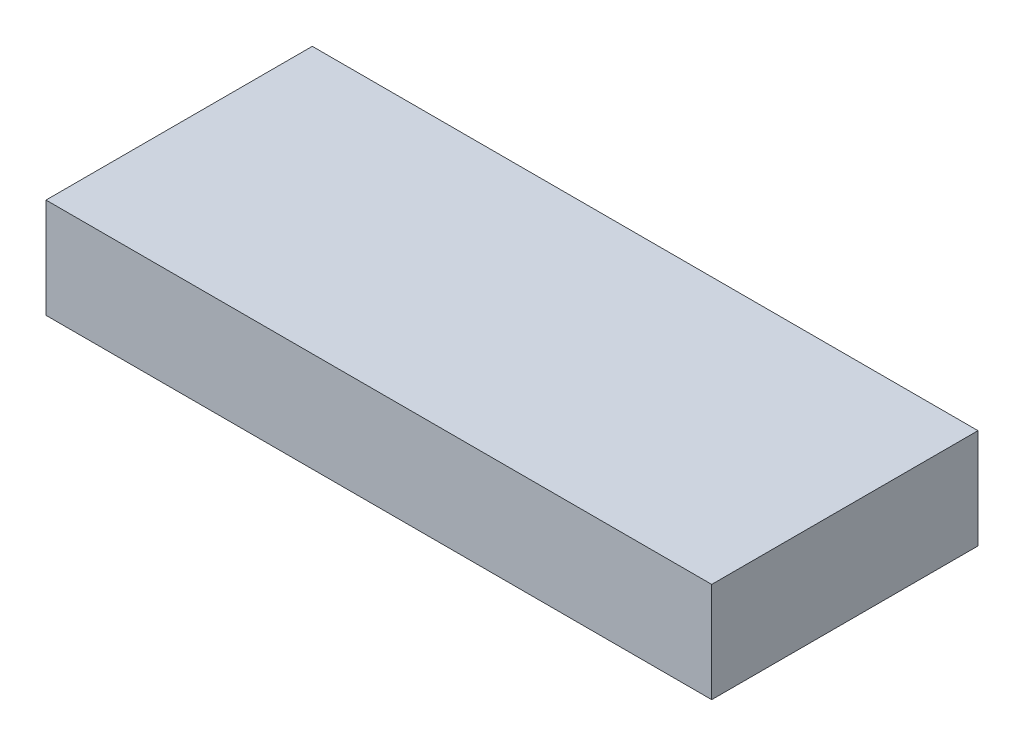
ISO-10303-21;
HEADER;
FILE_DESCRIPTION(('STEP AP214'),'2;1');
FILE_NAME('part.step','',(''),(''),'','','');
FILE_SCHEMA(('AUTOMOTIVE_DESIGN { 1 0 10303 214 1 1 1 1 }'));
ENDSEC;
DATA;
#1=APPLICATION_CONTEXT('core data for automotive mechanical design processes');
#2=APPLICATION_PROTOCOL_DEFINITION('international standard','automotive_design',2000,#1);
#3=PRODUCT_CONTEXT('',#1,'mechanical');
#4=PRODUCT('Part','Part','',(#3));
#5=PRODUCT_RELATED_PRODUCT_CATEGORY('part','',(#4));
#6=PRODUCT_DEFINITION_FORMATION('','',#4);
#7=PRODUCT_DEFINITION_CONTEXT('part definition',#1,'design');
#8=PRODUCT_DEFINITION('design','',#6,#7);
#9=PRODUCT_DEFINITION_SHAPE('','',#8);
#10=(LENGTH_UNIT() NAMED_UNIT(*) SI_UNIT(.MILLI.,.METRE.));
#11=(NAMED_UNIT(*) PLANE_ANGLE_UNIT() SI_UNIT($,.RADIAN.));
#12=(NAMED_UNIT(*) SI_UNIT($,.STERADIAN.) SOLID_ANGLE_UNIT());
#13=UNCERTAINTY_MEASURE_WITH_UNIT(LENGTH_MEASURE(1.E-05),#10,'distance_accuracy_value','');
#14=(GEOMETRIC_REPRESENTATION_CONTEXT(3) GLOBAL_UNCERTAINTY_ASSIGNED_CONTEXT((#13)) GLOBAL_UNIT_ASSIGNED_CONTEXT((#10,
#11,#12)) REPRESENTATION_CONTEXT('',''));
#15=CARTESIAN_POINT('',(0.,0.,0.));
#16=DIRECTION('',(0.,0.,1.));
#17=DIRECTION('',(1.,0.,0.));
#18=AXIS2_PLACEMENT_3D('',#15,#16,#17);
#19=CARTESIAN_POINT('',(0.,38.1,-101.6));
#20=DIRECTION('',(0.,0.,1.));
#21=DIRECTION('',(1.,0.,0.));
#22=AXIS2_PLACEMENT_3D('',#19,#20,#21);
#23=PLANE('',#22);
#24=DIRECTION('',(0.,1.,0.));
#25=VECTOR('',#24,1.);
#26=CARTESIAN_POINT('',(191.29375,38.1,-101.6));
#27=LINE('',#26,#25);
#28=CARTESIAN_POINT('',(191.29375,0.,-101.6));
#29=VERTEX_POINT('',#28);
#30=CARTESIAN_POINT('',(191.29375,6.35,-101.6));
#31=VERTEX_POINT('',#30);
#32=EDGE_CURVE('E575',#29,#31,#27,.T.);
#33=ORIENTED_EDGE('',*,*,#32,.F.);
#34=DIRECTION('',(-1.,0.,0.));
#35=VECTOR('',#34,1.);
#36=CARTESIAN_POINT('',(0.,0.,-101.6));
#37=LINE('',#36,#35);
#38=CARTESIAN_POINT('',(0.,0.,-101.6));
#39=VERTEX_POINT('',#38);
#40=EDGE_CURVE('E76',#29,#39,#37,.T.);
#41=ORIENTED_EDGE('',*,*,#40,.T.);
#42=DIRECTION('',(0.,-1.,0.));
#43=VECTOR('',#42,1.);
#44=CARTESIAN_POINT('',(0.,38.1,-101.6));
#45=LINE('',#44,#43);
#46=CARTESIAN_POINT('',(0.,38.1,-101.6));
#47=VERTEX_POINT('',#46);
#48=EDGE_CURVE('E585',#47,#39,#45,.T.);
#49=ORIENTED_EDGE('',*,*,#48,.F.);
#50=DIRECTION('',(-1.,0.,0.));
#51=VECTOR('',#50,1.);
#52=CARTESIAN_POINT('',(0.,38.1,-101.6));
#53=LINE('',#52,#51);
#54=CARTESIAN_POINT('',(254.,38.1,-101.6));
#55=VERTEX_POINT('',#54);
#56=EDGE_CURVE('E55',#55,#47,#53,.T.);
#57=ORIENTED_EDGE('',*,*,#56,.F.);
#58=DIRECTION('',(0.,-1.,0.));
#59=VECTOR('',#58,1.);
#60=CARTESIAN_POINT('',(254.,38.1,-101.6));
#61=LINE('',#60,#59);
#62=CARTESIAN_POINT('',(254.,0.,-101.6));
#63=VERTEX_POINT('',#62);
#64=EDGE_CURVE('E596',#55,#63,#61,.T.);
#65=ORIENTED_EDGE('',*,*,#64,.T.);
#66=CARTESIAN_POINT('',(218.28125,0.,-101.6));
#67=VERTEX_POINT('',#66);
#68=EDGE_CURVE('E580',#63,#67,#37,.T.);
#69=ORIENTED_EDGE('',*,*,#68,.T.);
#70=DIRECTION('',(0.,-1.,0.));
#71=VECTOR('',#70,1.);
#72=CARTESIAN_POINT('',(218.28125,38.1,-101.6));
#73=LINE('',#72,#71);
#74=CARTESIAN_POINT('',(218.28125,6.34999999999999,-101.6));
#75=VERTEX_POINT('',#74);
#76=EDGE_CURVE('E573',#75,#67,#73,.T.);
#77=ORIENTED_EDGE('',*,*,#76,.F.);
#78=DIRECTION('',(1.,0.,0.));
#79=VECTOR('',#78,1.);
#80=CARTESIAN_POINT('',(0.,6.34999999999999,-101.6));
#81=LINE('',#80,#79);
#82=CARTESIAN_POINT('',(231.775,6.34999999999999,-101.6));
#83=VERTEX_POINT('',#82);
#84=EDGE_CURVE('E604',#75,#83,#81,.T.);
#85=ORIENTED_EDGE('',*,*,#84,.T.);
#86=DIRECTION('',(0.,-1.,0.));
#87=VECTOR('',#86,1.);
#88=CARTESIAN_POINT('',(231.775,38.1,-101.6));
#89=LINE('',#88,#87);
#90=CARTESIAN_POINT('',(231.775,12.7,-101.6));
#91=VERTEX_POINT('',#90);
#92=EDGE_CURVE('E607',#91,#83,#89,.T.);
#93=ORIENTED_EDGE('',*,*,#92,.F.);
#94=DIRECTION('',(-1.,0.,0.));
#95=VECTOR('',#94,1.);
#96=CARTESIAN_POINT('',(0.,12.7,-101.6));
#97=LINE('',#96,#95);
#98=CARTESIAN_POINT('',(218.28125,12.7,-101.6));
#99=VERTEX_POINT('',#98);
#100=EDGE_CURVE('E609',#91,#99,#97,.T.);
#101=ORIENTED_EDGE('',*,*,#100,.T.);
#102=DIRECTION('',(0.,-1.,0.));
#103=VECTOR('',#102,1.);
#104=CARTESIAN_POINT('',(218.28125,38.1,-101.6));
#105=LINE('',#104,#103);
#106=CARTESIAN_POINT('',(218.28125,25.4,-101.6));
#107=VERTEX_POINT('',#106);
#108=EDGE_CURVE('E612',#107,#99,#105,.T.);
#109=ORIENTED_EDGE('',*,*,#108,.F.);
#110=DIRECTION('',(-1.,0.,0.));
#111=VECTOR('',#110,1.);
#112=CARTESIAN_POINT('',(0.,25.4,-101.6));
#113=LINE('',#112,#111);
#114=CARTESIAN_POINT('',(191.29375,25.4,-101.6));
#115=VERTEX_POINT('',#114);
#116=EDGE_CURVE('E614',#107,#115,#113,.T.);
#117=ORIENTED_EDGE('',*,*,#116,.T.);
#118=DIRECTION('',(0.,1.,0.));
#119=VECTOR('',#118,1.);
#120=CARTESIAN_POINT('',(191.29375,38.1,-101.6));
#121=LINE('',#120,#119);
#122=CARTESIAN_POINT('',(191.29375,12.7,-101.6));
#123=VERTEX_POINT('',#122);
#124=EDGE_CURVE('E617',#123,#115,#121,.T.);
#125=ORIENTED_EDGE('',*,*,#124,.F.);
#126=DIRECTION('',(-1.,0.,0.));
#127=VECTOR('',#126,1.);
#128=CARTESIAN_POINT('',(0.,12.7,-101.6));
#129=LINE('',#128,#127);
#130=CARTESIAN_POINT('',(177.8,12.7,-101.6));
#131=VERTEX_POINT('',#130);
#132=EDGE_CURVE('E619',#123,#131,#129,.T.);
#133=ORIENTED_EDGE('',*,*,#132,.T.);
#134=DIRECTION('',(0.,1.,0.));
#135=VECTOR('',#134,1.);
#136=CARTESIAN_POINT('',(177.8,38.1,-101.6));
#137=LINE('',#136,#135);
#138=CARTESIAN_POINT('',(177.8,6.35,-101.6));
#139=VERTEX_POINT('',#138);
#140=EDGE_CURVE('E39',#139,#131,#137,.T.);
#141=ORIENTED_EDGE('',*,*,#140,.F.);
#142=DIRECTION('',(1.,0.,0.));
#143=VECTOR('',#142,1.);
#144=CARTESIAN_POINT('',(0.,6.35,-101.6));
#145=LINE('',#144,#143);
#146=EDGE_CURVE('E11',#139,#31,#145,.T.);
#147=ORIENTED_EDGE('',*,*,#146,.T.);
#148=EDGE_LOOP('',(#33,#41,#49,#57,#65,#69,#77,#85,#93,#101,#109,#117,#125,#133,#141,#147));
#149=FACE_BOUND('',#148,.T.);
#150=ADVANCED_FACE('F31',(#149),#23,.F.);
#151=CARTESIAN_POINT('',(0.,0.,-101.6));
#152=DIRECTION('',(0.,-1.,0.));
#153=DIRECTION('',(0.,0.,-1.));
#154=AXIS2_PLACEMENT_3D('',#151,#152,#153);
#155=PLANE('',#154);
#156=ORIENTED_EDGE('',*,*,#40,.F.);
#157=DIRECTION('',(0.88235294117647,0.,-0.470588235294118));
#158=VECTOR('',#157,1.);
#159=CARTESIAN_POINT('',(169.582352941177,0.,-90.0205882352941));
#160=LINE('',#159,#158);
#161=CARTESIAN_POINT('',(169.582352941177,0.,-90.0205882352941));
#162=VERTEX_POINT('',#161);
#163=EDGE_CURVE('E571',#162,#29,#160,.T.);
#164=ORIENTED_EDGE('',*,*,#163,.F.);
#165=CARTESIAN_POINT('',(190.5,0.,-50.8));
#166=DIRECTION('',(0.,-1.,0.));
#167=DIRECTION('',(0.,0.,-1.));
#168=AXIS2_PLACEMENT_3D('',#165,#166,#167);
#169=CIRCLE('',#168,44.45);
#170=CARTESIAN_POINT('',(146.05,0.,-50.8));
#171=VERTEX_POINT('',#170);
#172=EDGE_CURVE('E535',#171,#162,#169,.T.);
#173=ORIENTED_EDGE('',*,*,#172,.F.);
#174=CARTESIAN_POINT('',(120.65,0.,-50.8));
#175=DIRECTION('',(0.,1.,0.));
#176=DIRECTION('',(0.,0.,1.));
#177=AXIS2_PLACEMENT_3D('',#174,#175,#176);
#178=CIRCLE('',#177,25.4);
#179=CARTESIAN_POINT('',(95.25,0.,-50.8));
#180=VERTEX_POINT('',#179);
#181=EDGE_CURVE('E482',#180,#171,#178,.T.);
#182=ORIENTED_EDGE('',*,*,#181,.F.);
#183=CARTESIAN_POINT('',(63.5,0.,-50.8));
#184=DIRECTION('',(0.,-1.,0.));
#185=DIRECTION('',(0.,0.,-1.));
#186=AXIS2_PLACEMENT_3D('',#183,#184,#185);
#187=CIRCLE('',#186,31.75);
#188=CARTESIAN_POINT('',(63.5,0.,-82.55));
#189=VERTEX_POINT('',#188);
#190=EDGE_CURVE('E431',#189,#180,#187,.T.);
#191=ORIENTED_EDGE('',*,*,#190,.F.);
#192=DIRECTION('',(-1.,0.,0.));
#193=VECTOR('',#192,1.);
#194=CARTESIAN_POINT('',(63.5,0.,-82.55));
#195=LINE('',#194,#193);
#196=CARTESIAN_POINT('',(0.,0.,-82.55));
#197=VERTEX_POINT('',#196);
#198=EDGE_CURVE('E367',#189,#197,#195,.T.);
#199=ORIENTED_EDGE('',*,*,#198,.T.);
#200=DIRECTION('',(0.,0.,1.));
#201=VECTOR('',#200,1.);
#202=CARTESIAN_POINT('',(0.,0.,0.));
#203=LINE('',#202,#201);
#204=EDGE_CURVE('E586',#39,#197,#203,.T.);
#205=ORIENTED_EDGE('',*,*,#204,.F.);
#206=EDGE_LOOP('',(#156,#164,#173,#182,#191,#199,#205));
#207=FACE_BOUND('',#206,.T.);
#208=ADVANCED_FACE('F674',(#207),#155,.T.);
#209=CARTESIAN_POINT('',(190.5,0.,-50.8));
#210=DIRECTION('',(0.,-1.,0.));
#211=DIRECTION('',(0.,0.,-1.));
#212=AXIS2_PLACEMENT_3D('',#209,#210,#211);
#213=CIRCLE('',#212,31.75);
#214=CARTESIAN_POINT('',(158.75,0.,-50.8));
#215=VERTEX_POINT('',#214);
#216=CARTESIAN_POINT('',(175.558823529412,0.,-78.8147058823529));
#217=VERTEX_POINT('',#216);
#218=EDGE_CURVE('E502',#215,#217,#213,.T.);
#219=ORIENTED_EDGE('',*,*,#218,.T.);
#220=DIRECTION('',(0.88235294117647,0.,-0.470588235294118));
#221=VECTOR('',#220,1.);
#222=CARTESIAN_POINT('',(175.558823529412,0.,-78.8147058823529));
#223=LINE('',#222,#221);
#224=EDGE_CURVE('E538',#217,#67,#223,.T.);
#225=ORIENTED_EDGE('',*,*,#224,.T.);
#226=ORIENTED_EDGE('',*,*,#68,.F.);
#227=DIRECTION('',(0.,0.,-1.));
#228=VECTOR('',#227,1.);
#229=CARTESIAN_POINT('',(254.,0.,0.));
#230=LINE('',#229,#228);
#231=CARTESIAN_POINT('',(254.,0.,0.));
#232=VERTEX_POINT('',#231);
#233=EDGE_CURVE('E591',#232,#63,#230,.T.);
#234=ORIENTED_EDGE('',*,*,#233,.F.);
#235=DIRECTION('',(1.,0.,0.));
#236=VECTOR('',#235,1.);
#237=CARTESIAN_POINT('',(0.,0.,0.));
#238=LINE('',#237,#236);
#239=CARTESIAN_POINT('',(0.,0.,0.));
#240=VERTEX_POINT('',#239);
#241=EDGE_CURVE('E589',#240,#232,#238,.T.);
#242=ORIENTED_EDGE('',*,*,#241,.F.);
#243=CARTESIAN_POINT('',(0.,0.,-69.85));
#244=VERTEX_POINT('',#243);
#245=EDGE_CURVE('E577',#244,#240,#203,.T.);
#246=ORIENTED_EDGE('',*,*,#245,.F.);
#247=DIRECTION('',(-1.,0.,0.));
#248=VECTOR('',#247,1.);
#249=CARTESIAN_POINT('',(63.5,0.,-69.85));
#250=LINE('',#249,#248);
#251=CARTESIAN_POINT('',(63.5,0.,-69.85));
#252=VERTEX_POINT('',#251);
#253=EDGE_CURVE('E316',#252,#244,#250,.T.);
#254=ORIENTED_EDGE('',*,*,#253,.F.);
#255=CARTESIAN_POINT('',(63.5,0.,-50.8));
#256=DIRECTION('',(0.,-1.,0.));
#257=DIRECTION('',(0.,0.,-1.));
#258=AXIS2_PLACEMENT_3D('',#255,#256,#257);
#259=CIRCLE('',#258,19.05);
#260=CARTESIAN_POINT('',(82.55,0.,-50.8));
#261=VERTEX_POINT('',#260);
#262=EDGE_CURVE('E309',#252,#261,#259,.T.);
#263=ORIENTED_EDGE('',*,*,#262,.T.);
#264=CARTESIAN_POINT('',(120.65,0.,-50.8));
#265=DIRECTION('',(0.,1.,0.));
#266=DIRECTION('',(0.,0.,1.));
#267=AXIS2_PLACEMENT_3D('',#264,#265,#266);
#268=CIRCLE('',#267,38.1);
#269=EDGE_CURVE('E451',#261,#215,#268,.T.);
#270=ORIENTED_EDGE('',*,*,#269,.T.);
#271=EDGE_LOOP('',(#219,#225,#226,#234,#242,#246,#254,#263,#270));
#272=FACE_BOUND('',#271,.T.);
#273=ADVANCED_FACE('F687',(#272),#155,.T.);
#274=CARTESIAN_POINT('',(0.,38.1,0.));
#275=DIRECTION('',(1.,0.,0.));
#276=DIRECTION('',(0.,0.,-1.));
#277=AXIS2_PLACEMENT_3D('',#274,#275,#276);
#278=PLANE('',#277);
#279=ORIENTED_EDGE('',*,*,#204,.T.);
#280=DIRECTION('',(0.,-1.,0.));
#281=VECTOR('',#280,1.);
#282=CARTESIAN_POINT('',(0.,0.,-82.55));
#283=LINE('',#282,#281);
#284=CARTESIAN_POINT('',(0.,6.35,-82.55));
#285=VERTEX_POINT('',#284);
#286=EDGE_CURVE('E322',#285,#197,#283,.T.);
#287=ORIENTED_EDGE('',*,*,#286,.F.);
#288=DIRECTION('',(0.,0.,1.));
#289=VECTOR('',#288,1.);
#290=CARTESIAN_POINT('',(0.,6.35,-82.55));
#291=LINE('',#290,#289);
#292=CARTESIAN_POINT('',(0.,6.35,-88.9));
#293=VERTEX_POINT('',#292);
#294=EDGE_CURVE('E327',#293,#285,#291,.T.);
#295=ORIENTED_EDGE('',*,*,#294,.F.);
#296=DIRECTION('',(0.,-1.,0.));
#297=VECTOR('',#296,1.);
#298=CARTESIAN_POINT('',(0.,6.35,-88.9));
#299=LINE('',#298,#297);
#300=CARTESIAN_POINT('',(0.,12.7,-88.9));
#301=VERTEX_POINT('',#300);
#302=EDGE_CURVE('E362',#301,#293,#299,.T.);
#303=ORIENTED_EDGE('',*,*,#302,.F.);
#304=DIRECTION('',(0.,0.,-1.));
#305=VECTOR('',#304,1.);
#306=CARTESIAN_POINT('',(0.,12.7,-88.9));
#307=LINE('',#306,#305);
#308=CARTESIAN_POINT('',(0.,12.7,-82.55));
#309=VERTEX_POINT('',#308);
#310=EDGE_CURVE('E359',#309,#301,#307,.T.);
#311=ORIENTED_EDGE('',*,*,#310,.F.);
#312=DIRECTION('',(0.,-1.,0.));
#313=VECTOR('',#312,1.);
#314=CARTESIAN_POINT('',(0.,12.7,-82.55));
#315=LINE('',#314,#313);
#316=CARTESIAN_POINT('',(0.,25.4,-82.55));
#317=VERTEX_POINT('',#316);
#318=EDGE_CURVE('E356',#317,#309,#315,.T.);
#319=ORIENTED_EDGE('',*,*,#318,.F.);
#320=DIRECTION('',(0.,0.,-1.));
#321=VECTOR('',#320,1.);
#322=CARTESIAN_POINT('',(0.,25.4,-82.55));
#323=LINE('',#322,#321);
#324=CARTESIAN_POINT('',(0.,25.4,-69.85));
#325=VERTEX_POINT('',#324);
#326=EDGE_CURVE('E353',#325,#317,#323,.T.);
#327=ORIENTED_EDGE('',*,*,#326,.F.);
#328=DIRECTION('',(0.,1.,0.));
#329=VECTOR('',#328,1.);
#330=CARTESIAN_POINT('',(0.,25.4,-69.85));
#331=LINE('',#330,#329);
#332=CARTESIAN_POINT('',(0.,12.7,-69.85));
#333=VERTEX_POINT('',#332);
#334=EDGE_CURVE('E350',#333,#325,#331,.T.);
#335=ORIENTED_EDGE('',*,*,#334,.F.);
#336=DIRECTION('',(0.,0.,-1.));
#337=VECTOR('',#336,1.);
#338=CARTESIAN_POINT('',(0.,12.7,-69.85));
#339=LINE('',#338,#337);
#340=CARTESIAN_POINT('',(0.,12.7,-63.5));
#341=VERTEX_POINT('',#340);
#342=EDGE_CURVE('E347',#341,#333,#339,.T.);
#343=ORIENTED_EDGE('',*,*,#342,.F.);
#344=DIRECTION('',(0.,1.,0.));
#345=VECTOR('',#344,1.);
#346=CARTESIAN_POINT('',(0.,12.7,-63.5));
#347=LINE('',#346,#345);
#348=CARTESIAN_POINT('',(0.,6.35,-63.5));
#349=VERTEX_POINT('',#348);
#350=EDGE_CURVE('E344',#349,#341,#347,.T.);
#351=ORIENTED_EDGE('',*,*,#350,.F.);
#352=DIRECTION('',(0.,0.,1.));
#353=VECTOR('',#352,1.);
#354=CARTESIAN_POINT('',(0.,6.35,-63.5));
#355=LINE('',#354,#353);
#356=CARTESIAN_POINT('',(0.,6.35,-69.85));
#357=VERTEX_POINT('',#356);
#358=EDGE_CURVE('E342',#357,#349,#355,.T.);
#359=ORIENTED_EDGE('',*,*,#358,.F.);
#360=DIRECTION('',(0.,1.,0.));
#361=VECTOR('',#360,1.);
#362=CARTESIAN_POINT('',(0.,6.35,-69.85));
#363=LINE('',#362,#361);
#364=EDGE_CURVE('E313',#244,#357,#363,.T.);
#365=ORIENTED_EDGE('',*,*,#364,.F.);
#366=ORIENTED_EDGE('',*,*,#245,.T.);
#367=DIRECTION('',(0.,-1.,0.));
#368=VECTOR('',#367,1.);
#369=CARTESIAN_POINT('',(0.,38.1,0.));
#370=LINE('',#369,#368);
#371=CARTESIAN_POINT('',(0.,38.1,0.));
#372=VERTEX_POINT('',#371);
#373=EDGE_CURVE('E602',#372,#240,#370,.T.);
#374=ORIENTED_EDGE('',*,*,#373,.F.);
#375=DIRECTION('',(0.,0.,1.));
#376=VECTOR('',#375,1.);
#377=CARTESIAN_POINT('',(0.,38.1,0.));
#378=LINE('',#377,#376);
#379=EDGE_CURVE('E578',#47,#372,#378,.T.);
#380=ORIENTED_EDGE('',*,*,#379,.F.);
#381=ORIENTED_EDGE('',*,*,#48,.T.);
#382=EDGE_LOOP('',(#279,#287,#295,#303,#311,#319,#327,#335,#343,#351,#359,#365,#366,#374,#380,#381));
#383=FACE_BOUND('',#382,.T.);
#384=ADVANCED_FACE('F33',(#383),#278,.F.);
#385=CARTESIAN_POINT('',(0.,38.1,0.));
#386=DIRECTION('',(0.,0.,-1.));
#387=DIRECTION('',(-1.,0.,0.));
#388=AXIS2_PLACEMENT_3D('',#385,#386,#387);
#389=PLANE('',#388);
#390=ORIENTED_EDGE('',*,*,#241,.T.);
#391=DIRECTION('',(0.,-1.,0.));
#392=VECTOR('',#391,1.);
#393=CARTESIAN_POINT('',(254.,38.1,0.));
#394=LINE('',#393,#392);
#395=CARTESIAN_POINT('',(254.,38.1,0.));
#396=VERTEX_POINT('',#395);
#397=EDGE_CURVE('E599',#396,#232,#394,.T.);
#398=ORIENTED_EDGE('',*,*,#397,.F.);
#399=DIRECTION('',(1.,0.,0.));
#400=VECTOR('',#399,1.);
#401=CARTESIAN_POINT('',(0.,38.1,0.));
#402=LINE('',#401,#400);
#403=EDGE_CURVE('E84',#372,#396,#402,.T.);
#404=ORIENTED_EDGE('',*,*,#403,.F.);
#405=ORIENTED_EDGE('',*,*,#373,.T.);
#406=EDGE_LOOP('',(#390,#398,#404,#405));
#407=FACE_BOUND('',#406,.T.);
#408=ADVANCED_FACE('F752',(#407),#389,.F.);
#409=CARTESIAN_POINT('',(254.,38.1,0.));
#410=DIRECTION('',(-1.,0.,0.));
#411=DIRECTION('',(0.,0.,1.));
#412=AXIS2_PLACEMENT_3D('',#409,#410,#411);
#413=PLANE('',#412);
#414=ORIENTED_EDGE('',*,*,#233,.T.);
#415=ORIENTED_EDGE('',*,*,#64,.F.);
#416=DIRECTION('',(0.,0.,-1.));
#417=VECTOR('',#416,1.);
#418=CARTESIAN_POINT('',(254.,38.1,0.));
#419=LINE('',#418,#417);
#420=EDGE_CURVE('E582',#396,#55,#419,.T.);
#421=ORIENTED_EDGE('',*,*,#420,.F.);
#422=ORIENTED_EDGE('',*,*,#397,.T.);
#423=EDGE_LOOP('',(#414,#415,#421,#422));
#424=FACE_BOUND('',#423,.T.);
#425=ADVANCED_FACE('F749',(#424),#413,.F.);
#426=CARTESIAN_POINT('',(0.,38.1,-101.6));
#427=DIRECTION('',(0.,-1.,0.));
#428=DIRECTION('',(0.,0.,-1.));
#429=AXIS2_PLACEMENT_3D('',#426,#427,#428);
#430=PLANE('',#429);
#431=ORIENTED_EDGE('',*,*,#379,.T.);
#432=ORIENTED_EDGE('',*,*,#403,.T.);
#433=ORIENTED_EDGE('',*,*,#420,.T.);
#434=ORIENTED_EDGE('',*,*,#56,.T.);
#435=EDGE_LOOP('',(#431,#432,#433,#434));
#436=FACE_BOUND('',#435,.T.);
#437=ADVANCED_FACE('F751',(#436),#430,.F.);
#438=CARTESIAN_POINT('',(166.594117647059,6.35,-95.6235294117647));
#439=DIRECTION('',(0.470588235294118,0.,0.882352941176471));
#440=DIRECTION('',(0.882352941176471,0.,-0.470588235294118));
#441=AXIS2_PLACEMENT_3D('',#438,#439,#440);
#442=PLANE('',#441);
#443=ORIENTED_EDGE('',*,*,#140,.T.);
#444=DIRECTION('',(0.88235294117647,0.,-0.470588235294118));
#445=VECTOR('',#444,1.);
#446=CARTESIAN_POINT('',(166.594117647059,12.7,-95.6235294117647));
#447=LINE('',#446,#445);
#448=CARTESIAN_POINT('',(166.594117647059,12.7,-95.6235294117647));
#449=VERTEX_POINT('',#448);
#450=EDGE_CURVE('E562',#449,#131,#447,.T.);
#451=ORIENTED_EDGE('',*,*,#450,.F.);
#452=DIRECTION('',(0.,-1.,0.));
#453=VECTOR('',#452,1.);
#454=CARTESIAN_POINT('',(166.594117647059,6.35,-95.6235294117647));
#455=LINE('',#454,#453);
#456=CARTESIAN_POINT('',(166.594117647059,6.35,-95.6235294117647));
#457=VERTEX_POINT('',#456);
#458=EDGE_CURVE('E497',#449,#457,#455,.T.);
#459=ORIENTED_EDGE('',*,*,#458,.T.);
#460=DIRECTION('',(0.88235294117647,0.,-0.470588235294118));
#461=VECTOR('',#460,1.);
#462=CARTESIAN_POINT('',(166.594117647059,6.35,-95.6235294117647));
#463=LINE('',#462,#461);
#464=EDGE_CURVE('E565',#457,#139,#463,.T.);
#465=ORIENTED_EDGE('',*,*,#464,.T.);
#466=EDGE_LOOP('',(#443,#451,#459,#465));
#467=FACE_BOUND('',#466,.T.);
#468=ADVANCED_FACE('F623',(#467),#442,.T.);
#469=CARTESIAN_POINT('',(169.582352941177,12.7,-90.0205882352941));
#470=DIRECTION('',(0.470588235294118,0.,0.88235294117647));
#471=DIRECTION('',(0.882352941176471,0.,-0.470588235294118));
#472=AXIS2_PLACEMENT_3D('',#469,#470,#471);
#473=PLANE('',#472);
#474=ORIENTED_EDGE('',*,*,#124,.T.);
#475=DIRECTION('',(0.88235294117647,0.,-0.470588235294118));
#476=VECTOR('',#475,1.);
#477=CARTESIAN_POINT('',(169.582352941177,25.4,-90.0205882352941));
#478=LINE('',#477,#476);
#479=CARTESIAN_POINT('',(169.582352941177,25.4,-90.0205882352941));
#480=VERTEX_POINT('',#479);
#481=EDGE_CURVE('E556',#480,#115,#478,.T.);
#482=ORIENTED_EDGE('',*,*,#481,.F.);
#483=DIRECTION('',(0.,-1.,0.));
#484=VECTOR('',#483,1.);
#485=CARTESIAN_POINT('',(169.582352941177,12.7,-90.0205882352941));
#486=LINE('',#485,#484);
#487=CARTESIAN_POINT('',(169.582352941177,12.7,-90.0205882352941));
#488=VERTEX_POINT('',#487);
#489=EDGE_CURVE('E494',#480,#488,#486,.T.);
#490=ORIENTED_EDGE('',*,*,#489,.T.);
#491=DIRECTION('',(0.88235294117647,0.,-0.470588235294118));
#492=VECTOR('',#491,1.);
#493=CARTESIAN_POINT('',(169.582352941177,12.7,-90.0205882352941));
#494=LINE('',#493,#492);
#495=EDGE_CURVE('E559',#488,#123,#494,.T.);
#496=ORIENTED_EDGE('',*,*,#495,.T.);
#497=EDGE_LOOP('',(#474,#482,#490,#496));
#498=FACE_BOUND('',#497,.T.);
#499=ADVANCED_FACE('F630',(#498),#473,.T.);
#500=CARTESIAN_POINT('',(175.558823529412,25.4,-78.8147058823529));
#501=DIRECTION('',(-0.470588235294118,0.,-0.88235294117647));
#502=DIRECTION('',(-0.882352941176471,0.,0.470588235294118));
#503=AXIS2_PLACEMENT_3D('',#500,#501,#502);
#504=PLANE('',#503);
#505=ORIENTED_EDGE('',*,*,#108,.T.);
#506=DIRECTION('',(0.88235294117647,0.,-0.470588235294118));
#507=VECTOR('',#506,1.);
#508=CARTESIAN_POINT('',(175.558823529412,12.7,-78.8147058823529));
#509=LINE('',#508,#507);
#510=CARTESIAN_POINT('',(175.558823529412,12.7,-78.8147058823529));
#511=VERTEX_POINT('',#510);
#512=EDGE_CURVE('E550',#511,#99,#509,.T.);
#513=ORIENTED_EDGE('',*,*,#512,.F.);
#514=DIRECTION('',(0.,1.,0.));
#515=VECTOR('',#514,1.);
#516=CARTESIAN_POINT('',(175.558823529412,25.4,-78.8147058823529));
#517=LINE('',#516,#515);
#518=CARTESIAN_POINT('',(175.558823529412,25.4,-78.8147058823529));
#519=VERTEX_POINT('',#518);
#520=EDGE_CURVE('E491',#511,#519,#517,.T.);
#521=ORIENTED_EDGE('',*,*,#520,.T.);
#522=DIRECTION('',(0.88235294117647,0.,-0.470588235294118));
#523=VECTOR('',#522,1.);
#524=CARTESIAN_POINT('',(175.558823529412,25.4,-78.8147058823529));
#525=LINE('',#524,#523);
#526=EDGE_CURVE('E553',#519,#107,#525,.T.);
#527=ORIENTED_EDGE('',*,*,#526,.T.);
#528=EDGE_LOOP('',(#505,#513,#521,#527));
#529=FACE_BOUND('',#528,.T.);
#530=ADVANCED_FACE('F710',(#529),#504,.T.);
#531=CARTESIAN_POINT('',(178.547058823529,12.7,-73.2117647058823));
#532=DIRECTION('',(-0.470588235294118,0.,-0.882352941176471));
#533=DIRECTION('',(-0.882352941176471,0.,0.470588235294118));
#534=AXIS2_PLACEMENT_3D('',#531,#532,#533);
#535=PLANE('',#534);
#536=ORIENTED_EDGE('',*,*,#92,.T.);
#537=DIRECTION('',(0.88235294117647,0.,-0.470588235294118));
#538=VECTOR('',#537,1.);
#539=CARTESIAN_POINT('',(178.547058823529,6.35,-73.2117647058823));
#540=LINE('',#539,#538);
#541=CARTESIAN_POINT('',(178.547058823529,6.35,-73.2117647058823));
#542=VERTEX_POINT('',#541);
#543=EDGE_CURVE('E544',#542,#83,#540,.T.);
#544=ORIENTED_EDGE('',*,*,#543,.F.);
#545=DIRECTION('',(0.,1.,0.));
#546=VECTOR('',#545,1.);
#547=CARTESIAN_POINT('',(178.547058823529,12.7,-73.2117647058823));
#548=LINE('',#547,#546);
#549=CARTESIAN_POINT('',(178.547058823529,12.7,-73.2117647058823));
#550=VERTEX_POINT('',#549);
#551=EDGE_CURVE('E488',#542,#550,#548,.T.);
#552=ORIENTED_EDGE('',*,*,#551,.T.);
#553=DIRECTION('',(0.88235294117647,0.,-0.470588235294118));
#554=VECTOR('',#553,1.);
#555=CARTESIAN_POINT('',(178.547058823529,12.7,-73.2117647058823));
#556=LINE('',#555,#554);
#557=EDGE_CURVE('E547',#550,#91,#556,.T.);
#558=ORIENTED_EDGE('',*,*,#557,.T.);
#559=EDGE_LOOP('',(#536,#544,#552,#558));
#560=FACE_BOUND('',#559,.T.);
#561=ADVANCED_FACE('F697',(#560),#535,.T.);
#562=CARTESIAN_POINT('',(63.5,6.35,-82.55));
#563=DIRECTION('',(0.,-1.,0.));
#564=DIRECTION('',(0.,0.,-1.));
#565=AXIS2_PLACEMENT_3D('',#562,#563,#564);
#566=PLANE('',#565);
#567=ORIENTED_EDGE('',*,*,#464,.F.);
#568=CARTESIAN_POINT('',(190.5,6.35,-50.8));
#569=DIRECTION('',(0.,-1.,0.));
#570=DIRECTION('',(0.,0.,-1.));
#571=AXIS2_PLACEMENT_3D('',#568,#569,#570);
#572=CIRCLE('',#571,50.8);
#573=CARTESIAN_POINT('',(139.7,6.35,-50.8));
#574=VERTEX_POINT('',#573);
#575=EDGE_CURVE('E529',#574,#457,#572,.T.);
#576=ORIENTED_EDGE('',*,*,#575,.F.);
#577=CARTESIAN_POINT('',(120.65,6.35,-50.8));
#578=DIRECTION('',(0.,1.,0.));
#579=DIRECTION('',(0.,0.,1.));
#580=AXIS2_PLACEMENT_3D('',#577,#578,#579);
#581=CIRCLE('',#580,19.05);
#582=CARTESIAN_POINT('',(101.6,6.35,-50.8));
#583=VERTEX_POINT('',#582);
#584=EDGE_CURVE('E476',#583,#574,#581,.T.);
#585=ORIENTED_EDGE('',*,*,#584,.F.);
#586=CARTESIAN_POINT('',(63.5,6.35,-50.8));
#587=DIRECTION('',(0.,-1.,0.));
#588=DIRECTION('',(0.,0.,-1.));
#589=AXIS2_PLACEMENT_3D('',#586,#587,#588);
#590=CIRCLE('',#589,38.1);
#591=CARTESIAN_POINT('',(63.5,6.35,-88.9));
#592=VERTEX_POINT('',#591);
#593=EDGE_CURVE('E425',#592,#583,#590,.T.);
#594=ORIENTED_EDGE('',*,*,#593,.F.);
#595=DIRECTION('',(-1.,0.,0.));
#596=VECTOR('',#595,1.);
#597=CARTESIAN_POINT('',(63.5,6.35,-88.9));
#598=LINE('',#597,#596);
#599=EDGE_CURVE('E373',#592,#293,#598,.T.);
#600=ORIENTED_EDGE('',*,*,#599,.T.);
#601=ORIENTED_EDGE('',*,*,#294,.T.);
#602=DIRECTION('',(-1.,0.,0.));
#603=VECTOR('',#602,1.);
#604=CARTESIAN_POINT('',(63.5,6.35,-82.55));
#605=LINE('',#604,#603);
#606=CARTESIAN_POINT('',(63.5,6.35,-82.55));
#607=VERTEX_POINT('',#606);
#608=EDGE_CURVE('E371',#607,#285,#605,.T.);
#609=ORIENTED_EDGE('',*,*,#608,.F.);
#610=CARTESIAN_POINT('',(63.5,6.35,-50.8));
#611=DIRECTION('',(0.,-1.,0.));
#612=DIRECTION('',(0.,0.,-1.));
#613=AXIS2_PLACEMENT_3D('',#610,#611,#612);
#614=CIRCLE('',#613,31.75);
#615=CARTESIAN_POINT('',(95.25,6.35,-50.8));
#616=VERTEX_POINT('',#615);
#617=EDGE_CURVE('E428',#607,#616,#614,.T.);
#618=ORIENTED_EDGE('',*,*,#617,.T.);
#619=CARTESIAN_POINT('',(120.65,6.35,-50.8));
#620=DIRECTION('',(0.,1.,0.));
#621=DIRECTION('',(0.,0.,1.));
#622=AXIS2_PLACEMENT_3D('',#619,#620,#621);
#623=CIRCLE('',#622,25.4);
#624=CARTESIAN_POINT('',(146.05,6.35,-50.8));
#625=VERTEX_POINT('',#624);
#626=EDGE_CURVE('E479',#616,#625,#623,.T.);
#627=ORIENTED_EDGE('',*,*,#626,.T.);
#628=CARTESIAN_POINT('',(190.5,6.35,-50.8));
#629=DIRECTION('',(0.,-1.,0.));
#630=DIRECTION('',(0.,0.,-1.));
#631=AXIS2_PLACEMENT_3D('',#628,#629,#630);
#632=CIRCLE('',#631,44.45);
#633=CARTESIAN_POINT('',(169.582352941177,6.35,-90.0205882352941));
#634=VERTEX_POINT('',#633);
#635=EDGE_CURVE('E532',#625,#634,#632,.T.);
#636=ORIENTED_EDGE('',*,*,#635,.T.);
#637=DIRECTION('',(0.88235294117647,0.,-0.470588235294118));
#638=VECTOR('',#637,1.);
#639=CARTESIAN_POINT('',(169.582352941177,6.35,-90.0205882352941));
#640=LINE('',#639,#638);
#641=EDGE_CURVE('E568',#634,#31,#640,.T.);
#642=ORIENTED_EDGE('',*,*,#641,.T.);
#643=ORIENTED_EDGE('',*,*,#146,.F.);
#644=EDGE_LOOP('',(#567,#576,#585,#594,#600,#601,#609,#618,#627,#636,#642,#643));
#645=FACE_BOUND('',#644,.T.);
#646=ADVANCED_FACE('F669',(#645),#566,.F.);
#647=CARTESIAN_POINT('',(63.5,12.7,-88.9));
#648=DIRECTION('',(0.,1.,0.));
#649=DIRECTION('',(0.,0.,1.));
#650=AXIS2_PLACEMENT_3D('',#647,#648,#649);
#651=PLANE('',#650);
#652=ORIENTED_EDGE('',*,*,#495,.F.);
#653=CARTESIAN_POINT('',(190.5,12.7,-50.8));
#654=DIRECTION('',(0.,-1.,0.));
#655=DIRECTION('',(0.,0.,-1.));
#656=AXIS2_PLACEMENT_3D('',#653,#654,#655);
#657=CIRCLE('',#656,44.45);
#658=CARTESIAN_POINT('',(146.05,12.7,-50.8));
#659=VERTEX_POINT('',#658);
#660=EDGE_CURVE('E523',#659,#488,#657,.T.);
#661=ORIENTED_EDGE('',*,*,#660,.F.);
#662=CARTESIAN_POINT('',(120.65,12.7,-50.8));
#663=DIRECTION('',(0.,1.,0.));
#664=DIRECTION('',(0.,0.,1.));
#665=AXIS2_PLACEMENT_3D('',#662,#663,#664);
#666=CIRCLE('',#665,25.4);
#667=CARTESIAN_POINT('',(95.25,12.7,-50.8));
#668=VERTEX_POINT('',#667);
#669=EDGE_CURVE('E470',#668,#659,#666,.T.);
#670=ORIENTED_EDGE('',*,*,#669,.F.);
#671=CARTESIAN_POINT('',(63.5,12.7,-50.8));
#672=DIRECTION('',(0.,-1.,0.));
#673=DIRECTION('',(0.,0.,-1.));
#674=AXIS2_PLACEMENT_3D('',#671,#672,#673);
#675=CIRCLE('',#674,31.75);
#676=CARTESIAN_POINT('',(63.5,12.7,-82.55));
#677=VERTEX_POINT('',#676);
#678=EDGE_CURVE('E419',#677,#668,#675,.T.);
#679=ORIENTED_EDGE('',*,*,#678,.F.);
#680=DIRECTION('',(-1.,0.,0.));
#681=VECTOR('',#680,1.);
#682=CARTESIAN_POINT('',(63.5,12.7,-82.55));
#683=LINE('',#682,#681);
#684=EDGE_CURVE('E377',#677,#309,#683,.T.);
#685=ORIENTED_EDGE('',*,*,#684,.T.);
#686=ORIENTED_EDGE('',*,*,#310,.T.);
#687=DIRECTION('',(-1.,0.,0.));
#688=VECTOR('',#687,1.);
#689=CARTESIAN_POINT('',(63.5,12.7,-88.9));
#690=LINE('',#689,#688);
#691=CARTESIAN_POINT('',(63.5,12.7,-88.9));
#692=VERTEX_POINT('',#691);
#693=EDGE_CURVE('E375',#692,#301,#690,.T.);
#694=ORIENTED_EDGE('',*,*,#693,.F.);
#695=CARTESIAN_POINT('',(63.5,12.7,-50.8));
#696=DIRECTION('',(0.,-1.,0.));
#697=DIRECTION('',(0.,0.,-1.));
#698=AXIS2_PLACEMENT_3D('',#695,#696,#697);
#699=CIRCLE('',#698,38.1);
#700=CARTESIAN_POINT('',(101.6,12.7,-50.8));
#701=VERTEX_POINT('',#700);
#702=EDGE_CURVE('E422',#692,#701,#699,.T.);
#703=ORIENTED_EDGE('',*,*,#702,.T.);
#704=CARTESIAN_POINT('',(120.65,12.7,-50.8));
#705=DIRECTION('',(0.,1.,0.));
#706=DIRECTION('',(0.,0.,1.));
#707=AXIS2_PLACEMENT_3D('',#704,#705,#706);
#708=CIRCLE('',#707,19.05);
#709=CARTESIAN_POINT('',(139.7,12.7,-50.8));
#710=VERTEX_POINT('',#709);
#711=EDGE_CURVE('E473',#701,#710,#708,.T.);
#712=ORIENTED_EDGE('',*,*,#711,.T.);
#713=CARTESIAN_POINT('',(190.5,12.7,-50.8));
#714=DIRECTION('',(0.,-1.,0.));
#715=DIRECTION('',(0.,0.,-1.));
#716=AXIS2_PLACEMENT_3D('',#713,#714,#715);
#717=CIRCLE('',#716,50.8);
#718=EDGE_CURVE('E526',#710,#449,#717,.T.);
#719=ORIENTED_EDGE('',*,*,#718,.T.);
#720=ORIENTED_EDGE('',*,*,#450,.T.);
#721=ORIENTED_EDGE('',*,*,#132,.F.);
#722=EDGE_LOOP('',(#652,#661,#670,#679,#685,#686,#694,#703,#712,#719,#720,#721));
#723=FACE_BOUND('',#722,.T.);
#724=ADVANCED_FACE('F626',(#723),#651,.F.);
#725=CARTESIAN_POINT('',(63.5,25.4,-82.55));
#726=DIRECTION('',(0.,1.,0.));
#727=DIRECTION('',(0.,0.,1.));
#728=AXIS2_PLACEMENT_3D('',#725,#726,#727);
#729=PLANE('',#728);
#730=ORIENTED_EDGE('',*,*,#526,.F.);
#731=CARTESIAN_POINT('',(190.5,25.4,-50.8));
#732=DIRECTION('',(0.,-1.,0.));
#733=DIRECTION('',(0.,0.,-1.));
#734=AXIS2_PLACEMENT_3D('',#731,#732,#733);
#735=CIRCLE('',#734,31.75);
#736=CARTESIAN_POINT('',(158.75,25.4,-50.8));
#737=VERTEX_POINT('',#736);
#738=EDGE_CURVE('E517',#737,#519,#735,.T.);
#739=ORIENTED_EDGE('',*,*,#738,.F.);
#740=CARTESIAN_POINT('',(120.65,25.4,-50.8));
#741=DIRECTION('',(0.,1.,0.));
#742=DIRECTION('',(0.,0.,1.));
#743=AXIS2_PLACEMENT_3D('',#740,#741,#742);
#744=CIRCLE('',#743,38.1);
#745=CARTESIAN_POINT('',(82.55,25.4,-50.8));
#746=VERTEX_POINT('',#745);
#747=EDGE_CURVE('E464',#746,#737,#744,.T.);
#748=ORIENTED_EDGE('',*,*,#747,.F.);
#749=CARTESIAN_POINT('',(63.5,25.4,-50.8));
#750=DIRECTION('',(0.,-1.,0.));
#751=DIRECTION('',(0.,0.,-1.));
#752=AXIS2_PLACEMENT_3D('',#749,#750,#751);
#753=CIRCLE('',#752,19.05);
#754=CARTESIAN_POINT('',(63.5,25.4,-69.85));
#755=VERTEX_POINT('',#754);
#756=EDGE_CURVE('E413',#755,#746,#753,.T.);
#757=ORIENTED_EDGE('',*,*,#756,.F.);
#758=DIRECTION('',(-1.,0.,0.));
#759=VECTOR('',#758,1.);
#760=CARTESIAN_POINT('',(63.5,25.4,-69.85));
#761=LINE('',#760,#759);
#762=EDGE_CURVE('E381',#755,#325,#761,.T.);
#763=ORIENTED_EDGE('',*,*,#762,.T.);
#764=ORIENTED_EDGE('',*,*,#326,.T.);
#765=DIRECTION('',(-1.,0.,0.));
#766=VECTOR('',#765,1.);
#767=CARTESIAN_POINT('',(63.5,25.4,-82.55));
#768=LINE('',#767,#766);
#769=CARTESIAN_POINT('',(63.5,25.4,-82.55));
#770=VERTEX_POINT('',#769);
#771=EDGE_CURVE('E379',#770,#317,#768,.T.);
#772=ORIENTED_EDGE('',*,*,#771,.F.);
#773=CARTESIAN_POINT('',(63.5,25.4,-50.8));
#774=DIRECTION('',(0.,-1.,0.));
#775=DIRECTION('',(0.,0.,-1.));
#776=AXIS2_PLACEMENT_3D('',#773,#774,#775);
#777=CIRCLE('',#776,31.75);
#778=CARTESIAN_POINT('',(95.25,25.4,-50.8));
#779=VERTEX_POINT('',#778);
#780=EDGE_CURVE('E416',#770,#779,#777,.T.);
#781=ORIENTED_EDGE('',*,*,#780,.T.);
#782=CARTESIAN_POINT('',(120.65,25.4,-50.8));
#783=DIRECTION('',(0.,1.,0.));
#784=DIRECTION('',(0.,0.,1.));
#785=AXIS2_PLACEMENT_3D('',#782,#783,#784);
#786=CIRCLE('',#785,25.4);
#787=CARTESIAN_POINT('',(146.05,25.4,-50.8));
#788=VERTEX_POINT('',#787);
#789=EDGE_CURVE('E467',#779,#788,#786,.T.);
#790=ORIENTED_EDGE('',*,*,#789,.T.);
#791=CARTESIAN_POINT('',(190.5,25.4,-50.8));
#792=DIRECTION('',(0.,-1.,0.));
#793=DIRECTION('',(0.,0.,-1.));
#794=AXIS2_PLACEMENT_3D('',#791,#792,#793);
#795=CIRCLE('',#794,44.45);
#796=EDGE_CURVE('E520',#788,#480,#795,.T.);
#797=ORIENTED_EDGE('',*,*,#796,.T.);
#798=ORIENTED_EDGE('',*,*,#481,.T.);
#799=ORIENTED_EDGE('',*,*,#116,.F.);
#800=EDGE_LOOP('',(#730,#739,#748,#757,#763,#764,#772,#781,#790,#797,#798,#799));
#801=FACE_BOUND('',#800,.T.);
#802=ADVANCED_FACE('F633',(#801),#729,.F.);
#803=CARTESIAN_POINT('',(63.5,12.7,-69.85));
#804=DIRECTION('',(0.,1.,0.));
#805=DIRECTION('',(0.,0.,1.));
#806=AXIS2_PLACEMENT_3D('',#803,#804,#805);
#807=PLANE('',#806);
#808=ORIENTED_EDGE('',*,*,#557,.F.);
#809=CARTESIAN_POINT('',(190.5,12.7,-50.8));
#810=DIRECTION('',(0.,-1.,0.));
#811=DIRECTION('',(0.,0.,-1.));
#812=AXIS2_PLACEMENT_3D('',#809,#810,#811);
#813=CIRCLE('',#812,25.4);
#814=CARTESIAN_POINT('',(165.1,12.7,-50.8));
#815=VERTEX_POINT('',#814);
#816=EDGE_CURVE('E511',#815,#550,#813,.T.);
#817=ORIENTED_EDGE('',*,*,#816,.F.);
#818=CARTESIAN_POINT('',(120.65,12.7,-50.8));
#819=DIRECTION('',(0.,1.,0.));
#820=DIRECTION('',(0.,0.,1.));
#821=AXIS2_PLACEMENT_3D('',#818,#819,#820);
#822=CIRCLE('',#821,44.45);
#823=CARTESIAN_POINT('',(76.2,12.7,-50.8));
#824=VERTEX_POINT('',#823);
#825=EDGE_CURVE('E458',#824,#815,#822,.T.);
#826=ORIENTED_EDGE('',*,*,#825,.F.);
#827=CARTESIAN_POINT('',(63.5,12.7,-50.8));
#828=DIRECTION('',(0.,-1.,0.));
#829=DIRECTION('',(0.,0.,-1.));
#830=AXIS2_PLACEMENT_3D('',#827,#828,#829);
#831=CIRCLE('',#830,12.7);
#832=CARTESIAN_POINT('',(63.5,12.7,-63.5));
#833=VERTEX_POINT('',#832);
#834=EDGE_CURVE('E407',#833,#824,#831,.T.);
#835=ORIENTED_EDGE('',*,*,#834,.F.);
#836=DIRECTION('',(-1.,0.,0.));
#837=VECTOR('',#836,1.);
#838=CARTESIAN_POINT('',(63.5,12.7,-63.5));
#839=LINE('',#838,#837);
#840=EDGE_CURVE('E385',#833,#341,#839,.T.);
#841=ORIENTED_EDGE('',*,*,#840,.T.);
#842=ORIENTED_EDGE('',*,*,#342,.T.);
#843=DIRECTION('',(-1.,0.,0.));
#844=VECTOR('',#843,1.);
#845=CARTESIAN_POINT('',(63.5,12.7,-69.85));
#846=LINE('',#845,#844);
#847=CARTESIAN_POINT('',(63.5,12.7,-69.85));
#848=VERTEX_POINT('',#847);
#849=EDGE_CURVE('E383',#848,#333,#846,.T.);
#850=ORIENTED_EDGE('',*,*,#849,.F.);
#851=CARTESIAN_POINT('',(63.5,12.7,-50.8));
#852=DIRECTION('',(0.,-1.,0.));
#853=DIRECTION('',(0.,0.,-1.));
#854=AXIS2_PLACEMENT_3D('',#851,#852,#853);
#855=CIRCLE('',#854,19.05);
#856=CARTESIAN_POINT('',(82.55,12.7,-50.8));
#857=VERTEX_POINT('',#856);
#858=EDGE_CURVE('E410',#848,#857,#855,.T.);
#859=ORIENTED_EDGE('',*,*,#858,.T.);
#860=CARTESIAN_POINT('',(120.65,12.7,-50.8));
#861=DIRECTION('',(0.,1.,0.));
#862=DIRECTION('',(0.,0.,1.));
#863=AXIS2_PLACEMENT_3D('',#860,#861,#862);
#864=CIRCLE('',#863,38.1);
#865=CARTESIAN_POINT('',(158.75,12.7,-50.8));
#866=VERTEX_POINT('',#865);
#867=EDGE_CURVE('E461',#857,#866,#864,.T.);
#868=ORIENTED_EDGE('',*,*,#867,.T.);
#869=CARTESIAN_POINT('',(190.5,12.7,-50.8));
#870=DIRECTION('',(0.,-1.,0.));
#871=DIRECTION('',(0.,0.,-1.));
#872=AXIS2_PLACEMENT_3D('',#869,#870,#871);
#873=CIRCLE('',#872,31.75);
#874=EDGE_CURVE('E514',#866,#511,#873,.T.);
#875=ORIENTED_EDGE('',*,*,#874,.T.);
#876=ORIENTED_EDGE('',*,*,#512,.T.);
#877=ORIENTED_EDGE('',*,*,#100,.F.);
#878=EDGE_LOOP('',(#808,#817,#826,#835,#841,#842,#850,#859,#868,#875,#876,#877));
#879=FACE_BOUND('',#878,.T.);
#880=ADVANCED_FACE('F706',(#879),#807,.F.);
#881=CARTESIAN_POINT('',(63.5,6.35,-63.5));
#882=DIRECTION('',(0.,-1.,0.));
#883=DIRECTION('',(0.,0.,-1.));
#884=AXIS2_PLACEMENT_3D('',#881,#882,#883);
#885=PLANE('',#884);
#886=DIRECTION('',(0.88235294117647,0.,-0.470588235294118));
#887=VECTOR('',#886,1.);
#888=CARTESIAN_POINT('',(175.558823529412,6.35,-78.8147058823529));
#889=LINE('',#888,#887);
#890=CARTESIAN_POINT('',(175.558823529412,6.35,-78.8147058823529));
#891=VERTEX_POINT('',#890);
#892=EDGE_CURVE('E541',#891,#75,#889,.T.);
#893=ORIENTED_EDGE('',*,*,#892,.F.);
#894=CARTESIAN_POINT('',(190.5,6.35,-50.8));
#895=DIRECTION('',(0.,-1.,0.));
#896=DIRECTION('',(0.,0.,-1.));
#897=AXIS2_PLACEMENT_3D('',#894,#895,#896);
#898=CIRCLE('',#897,31.75);
#899=CARTESIAN_POINT('',(158.75,6.35,-50.8));
#900=VERTEX_POINT('',#899);
#901=EDGE_CURVE('E505',#900,#891,#898,.T.);
#902=ORIENTED_EDGE('',*,*,#901,.F.);
#903=CARTESIAN_POINT('',(120.65,6.35,-50.8));
#904=DIRECTION('',(0.,1.,0.));
#905=DIRECTION('',(0.,0.,1.));
#906=AXIS2_PLACEMENT_3D('',#903,#904,#905);
#907=CIRCLE('',#906,38.1);
#908=CARTESIAN_POINT('',(82.55,6.35,-50.8));
#909=VERTEX_POINT('',#908);
#910=EDGE_CURVE('E304',#909,#900,#907,.T.);
#911=ORIENTED_EDGE('',*,*,#910,.F.);
#912=CARTESIAN_POINT('',(63.5,6.35,-50.8));
#913=DIRECTION('',(0.,-1.,0.));
#914=DIRECTION('',(0.,0.,-1.));
#915=AXIS2_PLACEMENT_3D('',#912,#913,#914);
#916=CIRCLE('',#915,19.05);
#917=CARTESIAN_POINT('',(63.5,6.35,-69.85));
#918=VERTEX_POINT('',#917);
#919=EDGE_CURVE('E298',#918,#909,#916,.T.);
#920=ORIENTED_EDGE('',*,*,#919,.F.);
#921=DIRECTION('',(-1.,0.,0.));
#922=VECTOR('',#921,1.);
#923=CARTESIAN_POINT('',(63.5,6.35,-69.85));
#924=LINE('',#923,#922);
#925=EDGE_CURVE('E301',#918,#357,#924,.T.);
#926=ORIENTED_EDGE('',*,*,#925,.T.);
#927=ORIENTED_EDGE('',*,*,#358,.T.);
#928=DIRECTION('',(-1.,0.,0.));
#929=VECTOR('',#928,1.);
#930=CARTESIAN_POINT('',(63.5,6.35,-63.5));
#931=LINE('',#930,#929);
#932=CARTESIAN_POINT('',(63.5,6.35,-63.5));
#933=VERTEX_POINT('',#932);
#934=EDGE_CURVE('E315',#933,#349,#931,.T.);
#935=ORIENTED_EDGE('',*,*,#934,.F.);
#936=CARTESIAN_POINT('',(63.5,6.35,-50.8));
#937=DIRECTION('',(0.,-1.,0.));
#938=DIRECTION('',(0.,0.,-1.));
#939=AXIS2_PLACEMENT_3D('',#936,#937,#938);
#940=CIRCLE('',#939,12.7);
#941=CARTESIAN_POINT('',(76.2,6.35,-50.8));
#942=VERTEX_POINT('',#941);
#943=EDGE_CURVE('E308',#933,#942,#940,.T.);
#944=ORIENTED_EDGE('',*,*,#943,.T.);
#945=CARTESIAN_POINT('',(120.65,6.35,-50.8));
#946=DIRECTION('',(0.,1.,0.));
#947=DIRECTION('',(0.,0.,1.));
#948=AXIS2_PLACEMENT_3D('',#945,#946,#947);
#949=CIRCLE('',#948,44.45);
#950=CARTESIAN_POINT('',(165.1,6.35,-50.8));
#951=VERTEX_POINT('',#950);
#952=EDGE_CURVE('E455',#942,#951,#949,.T.);
#953=ORIENTED_EDGE('',*,*,#952,.T.);
#954=CARTESIAN_POINT('',(190.5,6.35,-50.8));
#955=DIRECTION('',(0.,-1.,0.));
#956=DIRECTION('',(0.,0.,-1.));
#957=AXIS2_PLACEMENT_3D('',#954,#955,#956);
#958=CIRCLE('',#957,25.4);
#959=EDGE_CURVE('E508',#951,#542,#958,.T.);
#960=ORIENTED_EDGE('',*,*,#959,.T.);
#961=ORIENTED_EDGE('',*,*,#543,.T.);
#962=ORIENTED_EDGE('',*,*,#84,.F.);
#963=EDGE_LOOP('',(#893,#902,#911,#920,#926,#927,#935,#944,#953,#960,#961,#962));
#964=FACE_BOUND('',#963,.T.);
#965=ADVANCED_FACE('F299',(#964),#885,.F.);
#966=CARTESIAN_POINT('',(169.582352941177,0.,-90.0205882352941));
#967=DIRECTION('',(0.470588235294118,0.,0.88235294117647));
#968=DIRECTION('',(0.882352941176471,0.,-0.470588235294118));
#969=AXIS2_PLACEMENT_3D('',#966,#967,#968);
#970=PLANE('',#969);
#971=ORIENTED_EDGE('',*,*,#32,.T.);
#972=ORIENTED_EDGE('',*,*,#641,.F.);
#973=DIRECTION('',(0.,-1.,0.));
#974=VECTOR('',#973,1.);
#975=CARTESIAN_POINT('',(169.582352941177,0.,-90.0205882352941));
#976=LINE('',#975,#974);
#977=EDGE_CURVE('E500',#634,#162,#976,.T.);
#978=ORIENTED_EDGE('',*,*,#977,.T.);
#979=ORIENTED_EDGE('',*,*,#163,.T.);
#980=EDGE_LOOP('',(#971,#972,#978,#979));
#981=FACE_BOUND('',#980,.T.);
#982=ADVANCED_FACE('F799',(#981),#970,.T.);
#983=CARTESIAN_POINT('',(175.558823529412,6.35,-78.8147058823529));
#984=DIRECTION('',(-0.470588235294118,0.,-0.882352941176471));
#985=DIRECTION('',(-0.882352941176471,0.,0.470588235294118));
#986=AXIS2_PLACEMENT_3D('',#983,#984,#985);
#987=PLANE('',#986);
#988=ORIENTED_EDGE('',*,*,#76,.T.);
#989=ORIENTED_EDGE('',*,*,#224,.F.);
#990=DIRECTION('',(0.,1.,0.));
#991=VECTOR('',#990,1.);
#992=CARTESIAN_POINT('',(175.558823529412,6.35,-78.8147058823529));
#993=LINE('',#992,#991);
#994=EDGE_CURVE('E485',#217,#891,#993,.T.);
#995=ORIENTED_EDGE('',*,*,#994,.T.);
#996=ORIENTED_EDGE('',*,*,#892,.T.);
#997=EDGE_LOOP('',(#988,#989,#995,#996));
#998=FACE_BOUND('',#997,.T.);
#999=ADVANCED_FACE('F691',(#998),#987,.T.);
#1000=CARTESIAN_POINT('',(190.5,0.,-50.8));
#1001=DIRECTION('',(0.,-1.,0.));
#1002=DIRECTION('',(0.,0.,-1.));
#1003=AXIS2_PLACEMENT_3D('',#1000,#1001,#1002);
#1004=CYLINDRICAL_SURFACE('',#1003,44.45);
#1005=DIRECTION('',(0.,-1.,0.));
#1006=VECTOR('',#1005,1.);
#1007=CARTESIAN_POINT('',(146.05,0.,-50.8));
#1008=LINE('',#1007,#1006);
#1009=EDGE_CURVE('E449',#625,#171,#1008,.T.);
#1010=ORIENTED_EDGE('',*,*,#1009,.T.);
#1011=ORIENTED_EDGE('',*,*,#172,.T.);
#1012=ORIENTED_EDGE('',*,*,#977,.F.);
#1013=ORIENTED_EDGE('',*,*,#635,.F.);
#1014=EDGE_LOOP('',(#1010,#1011,#1012,#1013));
#1015=FACE_BOUND('',#1014,.T.);
#1016=ADVANCED_FACE('F793',(#1015),#1004,.F.);
#1017=CARTESIAN_POINT('',(190.5,0.,-50.8));
#1018=DIRECTION('',(0.,-1.,0.));
#1019=DIRECTION('',(0.,0.,-1.));
#1020=AXIS2_PLACEMENT_3D('',#1017,#1018,#1019);
#1021=CYLINDRICAL_SURFACE('',#1020,50.8);
#1022=DIRECTION('',(0.,-1.,0.));
#1023=VECTOR('',#1022,1.);
#1024=CARTESIAN_POINT('',(139.7,6.35,-50.8));
#1025=LINE('',#1024,#1023);
#1026=EDGE_CURVE('E446',#710,#574,#1025,.T.);
#1027=ORIENTED_EDGE('',*,*,#1026,.T.);
#1028=ORIENTED_EDGE('',*,*,#575,.T.);
#1029=ORIENTED_EDGE('',*,*,#458,.F.);
#1030=ORIENTED_EDGE('',*,*,#718,.F.);
#1031=EDGE_LOOP('',(#1027,#1028,#1029,#1030));
#1032=FACE_BOUND('',#1031,.T.);
#1033=ADVANCED_FACE('F667',(#1032),#1021,.F.);
#1034=CARTESIAN_POINT('',(190.5,0.,-50.8));
#1035=DIRECTION('',(0.,-1.,0.));
#1036=DIRECTION('',(0.,0.,-1.));
#1037=AXIS2_PLACEMENT_3D('',#1034,#1035,#1036);
#1038=CYLINDRICAL_SURFACE('',#1037,44.45);
#1039=DIRECTION('',(0.,-1.,0.));
#1040=VECTOR('',#1039,1.);
#1041=CARTESIAN_POINT('',(146.05,12.7,-50.8));
#1042=LINE('',#1041,#1040);
#1043=EDGE_CURVE('E443',#788,#659,#1042,.T.);
#1044=ORIENTED_EDGE('',*,*,#1043,.T.);
#1045=ORIENTED_EDGE('',*,*,#660,.T.);
#1046=ORIENTED_EDGE('',*,*,#489,.F.);
#1047=ORIENTED_EDGE('',*,*,#796,.F.);
#1048=EDGE_LOOP('',(#1044,#1045,#1046,#1047));
#1049=FACE_BOUND('',#1048,.T.);
#1050=ADVANCED_FACE('F636',(#1049),#1038,.F.);
#1051=CARTESIAN_POINT('',(190.5,0.,-50.8));
#1052=DIRECTION('',(0.,-1.,0.));
#1053=DIRECTION('',(0.,0.,-1.));
#1054=AXIS2_PLACEMENT_3D('',#1051,#1052,#1053);
#1055=CYLINDRICAL_SURFACE('',#1054,31.75);
#1056=DIRECTION('',(0.,1.,0.));
#1057=VECTOR('',#1056,1.);
#1058=CARTESIAN_POINT('',(158.75,25.4,-50.8));
#1059=LINE('',#1058,#1057);
#1060=EDGE_CURVE('E440',#866,#737,#1059,.T.);
#1061=ORIENTED_EDGE('',*,*,#1060,.T.);
#1062=ORIENTED_EDGE('',*,*,#738,.T.);
#1063=ORIENTED_EDGE('',*,*,#520,.F.);
#1064=ORIENTED_EDGE('',*,*,#874,.F.);
#1065=EDGE_LOOP('',(#1061,#1062,#1063,#1064));
#1066=FACE_BOUND('',#1065,.T.);
#1067=ADVANCED_FACE('F712',(#1066),#1055,.T.);
#1068=CARTESIAN_POINT('',(190.5,0.,-50.8));
#1069=DIRECTION('',(0.,-1.,0.));
#1070=DIRECTION('',(0.,0.,-1.));
#1071=AXIS2_PLACEMENT_3D('',#1068,#1069,#1070);
#1072=CYLINDRICAL_SURFACE('',#1071,25.4);
#1073=DIRECTION('',(0.,1.,0.));
#1074=VECTOR('',#1073,1.);
#1075=CARTESIAN_POINT('',(165.1,12.7,-50.8));
#1076=LINE('',#1075,#1074);
#1077=EDGE_CURVE('E437',#951,#815,#1076,.T.);
#1078=ORIENTED_EDGE('',*,*,#1077,.T.);
#1079=ORIENTED_EDGE('',*,*,#816,.T.);
#1080=ORIENTED_EDGE('',*,*,#551,.F.);
#1081=ORIENTED_EDGE('',*,*,#959,.F.);
#1082=EDGE_LOOP('',(#1078,#1079,#1080,#1081));
#1083=FACE_BOUND('',#1082,.T.);
#1084=ADVANCED_FACE('F701',(#1083),#1072,.T.);
#1085=CARTESIAN_POINT('',(190.5,0.,-50.8));
#1086=DIRECTION('',(0.,-1.,0.));
#1087=DIRECTION('',(0.,0.,-1.));
#1088=AXIS2_PLACEMENT_3D('',#1085,#1086,#1087);
#1089=CYLINDRICAL_SURFACE('',#1088,31.75);
#1090=DIRECTION('',(0.,1.,0.));
#1091=VECTOR('',#1090,1.);
#1092=CARTESIAN_POINT('',(158.75,6.35,-50.8));
#1093=LINE('',#1092,#1091);
#1094=EDGE_CURVE('E434',#215,#900,#1093,.T.);
#1095=ORIENTED_EDGE('',*,*,#1094,.T.);
#1096=ORIENTED_EDGE('',*,*,#901,.T.);
#1097=ORIENTED_EDGE('',*,*,#994,.F.);
#1098=ORIENTED_EDGE('',*,*,#218,.F.);
#1099=EDGE_LOOP('',(#1095,#1096,#1097,#1098));
#1100=FACE_BOUND('',#1099,.T.);
#1101=ADVANCED_FACE('F693',(#1100),#1089,.T.);
#1102=CARTESIAN_POINT('',(120.65,0.,-50.8));
#1103=DIRECTION('',(0.,1.,0.));
#1104=DIRECTION('',(0.,0.,1.));
#1105=AXIS2_PLACEMENT_3D('',#1102,#1103,#1104);
#1106=CYLINDRICAL_SURFACE('',#1105,25.4);
#1107=DIRECTION('',(0.,-1.,0.));
#1108=VECTOR('',#1107,1.);
#1109=CARTESIAN_POINT('',(95.25,0.,-50.8));
#1110=LINE('',#1109,#1108);
#1111=EDGE_CURVE('E402',#616,#180,#1110,.T.);
#1112=ORIENTED_EDGE('',*,*,#1111,.T.);
#1113=ORIENTED_EDGE('',*,*,#181,.T.);
#1114=ORIENTED_EDGE('',*,*,#1009,.F.);
#1115=ORIENTED_EDGE('',*,*,#626,.F.);
#1116=EDGE_LOOP('',(#1112,#1113,#1114,#1115));
#1117=FACE_BOUND('',#1116,.T.);
#1118=ADVANCED_FACE('F779',(#1117),#1106,.T.);
#1119=CARTESIAN_POINT('',(120.65,0.,-50.8));
#1120=DIRECTION('',(0.,1.,0.));
#1121=DIRECTION('',(0.,0.,1.));
#1122=AXIS2_PLACEMENT_3D('',#1119,#1120,#1121);
#1123=CYLINDRICAL_SURFACE('',#1122,19.05);
#1124=DIRECTION('',(0.,-1.,0.));
#1125=VECTOR('',#1124,1.);
#1126=CARTESIAN_POINT('',(101.6,6.35,-50.8));
#1127=LINE('',#1126,#1125);
#1128=EDGE_CURVE('E399',#701,#583,#1127,.T.);
#1129=ORIENTED_EDGE('',*,*,#1128,.T.);
#1130=ORIENTED_EDGE('',*,*,#584,.T.);
#1131=ORIENTED_EDGE('',*,*,#1026,.F.);
#1132=ORIENTED_EDGE('',*,*,#711,.F.);
#1133=EDGE_LOOP('',(#1129,#1130,#1131,#1132));
#1134=FACE_BOUND('',#1133,.T.);
#1135=ADVANCED_FACE('F664',(#1134),#1123,.T.);
#1136=CARTESIAN_POINT('',(120.65,0.,-50.8));
#1137=DIRECTION('',(0.,1.,0.));
#1138=DIRECTION('',(0.,0.,1.));
#1139=AXIS2_PLACEMENT_3D('',#1136,#1137,#1138);
#1140=CYLINDRICAL_SURFACE('',#1139,25.4);
#1141=DIRECTION('',(0.,-1.,0.));
#1142=VECTOR('',#1141,1.);
#1143=CARTESIAN_POINT('',(95.25,12.7,-50.8));
#1144=LINE('',#1143,#1142);
#1145=EDGE_CURVE('E396',#779,#668,#1144,.T.);
#1146=ORIENTED_EDGE('',*,*,#1145,.T.);
#1147=ORIENTED_EDGE('',*,*,#669,.T.);
#1148=ORIENTED_EDGE('',*,*,#1043,.F.);
#1149=ORIENTED_EDGE('',*,*,#789,.F.);
#1150=EDGE_LOOP('',(#1146,#1147,#1148,#1149));
#1151=FACE_BOUND('',#1150,.T.);
#1152=ADVANCED_FACE('F638',(#1151),#1140,.T.);
#1153=CARTESIAN_POINT('',(120.65,0.,-50.8));
#1154=DIRECTION('',(0.,1.,0.));
#1155=DIRECTION('',(0.,0.,1.));
#1156=AXIS2_PLACEMENT_3D('',#1153,#1154,#1155);
#1157=CYLINDRICAL_SURFACE('',#1156,38.1);
#1158=DIRECTION('',(0.,1.,0.));
#1159=VECTOR('',#1158,1.);
#1160=CARTESIAN_POINT('',(82.55,25.4,-50.8));
#1161=LINE('',#1160,#1159);
#1162=EDGE_CURVE('E393',#857,#746,#1161,.T.);
#1163=ORIENTED_EDGE('',*,*,#1162,.T.);
#1164=ORIENTED_EDGE('',*,*,#747,.T.);
#1165=ORIENTED_EDGE('',*,*,#1060,.F.);
#1166=ORIENTED_EDGE('',*,*,#867,.F.);
#1167=EDGE_LOOP('',(#1163,#1164,#1165,#1166));
#1168=FACE_BOUND('',#1167,.T.);
#1169=ADVANCED_FACE('F716',(#1168),#1157,.F.);
#1170=CARTESIAN_POINT('',(120.65,0.,-50.8));
#1171=DIRECTION('',(0.,1.,0.));
#1172=DIRECTION('',(0.,0.,1.));
#1173=AXIS2_PLACEMENT_3D('',#1170,#1171,#1172);
#1174=CYLINDRICAL_SURFACE('',#1173,44.45);
#1175=DIRECTION('',(0.,1.,0.));
#1176=VECTOR('',#1175,1.);
#1177=CARTESIAN_POINT('',(76.2,12.7,-50.8));
#1178=LINE('',#1177,#1176);
#1179=EDGE_CURVE('E390',#942,#824,#1178,.T.);
#1180=ORIENTED_EDGE('',*,*,#1179,.T.);
#1181=ORIENTED_EDGE('',*,*,#825,.T.);
#1182=ORIENTED_EDGE('',*,*,#1077,.F.);
#1183=ORIENTED_EDGE('',*,*,#952,.F.);
#1184=EDGE_LOOP('',(#1180,#1181,#1182,#1183));
#1185=FACE_BOUND('',#1184,.T.);
#1186=ADVANCED_FACE('F703',(#1185),#1174,.F.);
#1187=CARTESIAN_POINT('',(120.65,0.,-50.8));
#1188=DIRECTION('',(0.,1.,0.));
#1189=DIRECTION('',(0.,0.,1.));
#1190=AXIS2_PLACEMENT_3D('',#1187,#1188,#1189);
#1191=CYLINDRICAL_SURFACE('',#1190,38.1);
#1192=DIRECTION('',(0.,1.,0.));
#1193=VECTOR('',#1192,1.);
#1194=CARTESIAN_POINT('',(82.55,6.35,-50.8));
#1195=LINE('',#1194,#1193);
#1196=EDGE_CURVE('E370',#261,#909,#1195,.T.);
#1197=ORIENTED_EDGE('',*,*,#1196,.T.);
#1198=ORIENTED_EDGE('',*,*,#910,.T.);
#1199=ORIENTED_EDGE('',*,*,#1094,.F.);
#1200=ORIENTED_EDGE('',*,*,#269,.F.);
#1201=EDGE_LOOP('',(#1197,#1198,#1199,#1200));
#1202=FACE_BOUND('',#1201,.T.);
#1203=ADVANCED_FACE('F760',(#1202),#1191,.F.);
#1204=CARTESIAN_POINT('',(63.5,0.,-50.8));
#1205=DIRECTION('',(0.,-1.,0.));
#1206=DIRECTION('',(0.,0.,-1.));
#1207=AXIS2_PLACEMENT_3D('',#1204,#1205,#1206);
#1208=CYLINDRICAL_SURFACE('',#1207,31.75);
#1209=DIRECTION('',(0.,-1.,0.));
#1210=VECTOR('',#1209,1.);
#1211=CARTESIAN_POINT('',(63.5,0.,-82.55));
#1212=LINE('',#1211,#1210);
#1213=EDGE_CURVE('E338',#607,#189,#1212,.T.);
#1214=ORIENTED_EDGE('',*,*,#1213,.T.);
#1215=ORIENTED_EDGE('',*,*,#190,.T.);
#1216=ORIENTED_EDGE('',*,*,#1111,.F.);
#1217=ORIENTED_EDGE('',*,*,#617,.F.);
#1218=EDGE_LOOP('',(#1214,#1215,#1216,#1217));
#1219=FACE_BOUND('',#1218,.T.);
#1220=ADVANCED_FACE('F762',(#1219),#1208,.F.);
#1221=CARTESIAN_POINT('',(63.5,0.,-50.8));
#1222=DIRECTION('',(0.,-1.,0.));
#1223=DIRECTION('',(0.,0.,-1.));
#1224=AXIS2_PLACEMENT_3D('',#1221,#1222,#1223);
#1225=CYLINDRICAL_SURFACE('',#1224,38.1);
#1226=DIRECTION('',(0.,-1.,0.));
#1227=VECTOR('',#1226,1.);
#1228=CARTESIAN_POINT('',(63.5,6.35,-88.9));
#1229=LINE('',#1228,#1227);
#1230=EDGE_CURVE('E335',#692,#592,#1229,.T.);
#1231=ORIENTED_EDGE('',*,*,#1230,.T.);
#1232=ORIENTED_EDGE('',*,*,#593,.T.);
#1233=ORIENTED_EDGE('',*,*,#1128,.F.);
#1234=ORIENTED_EDGE('',*,*,#702,.F.);
#1235=EDGE_LOOP('',(#1231,#1232,#1233,#1234));
#1236=FACE_BOUND('',#1235,.T.);
#1237=ADVANCED_FACE('F661',(#1236),#1225,.F.);
#1238=CARTESIAN_POINT('',(63.5,0.,-50.8));
#1239=DIRECTION('',(0.,-1.,0.));
#1240=DIRECTION('',(0.,0.,-1.));
#1241=AXIS2_PLACEMENT_3D('',#1238,#1239,#1240);
#1242=CYLINDRICAL_SURFACE('',#1241,31.75);
#1243=DIRECTION('',(0.,-1.,0.));
#1244=VECTOR('',#1243,1.);
#1245=CARTESIAN_POINT('',(63.5,12.7,-82.55));
#1246=LINE('',#1245,#1244);
#1247=EDGE_CURVE('E332',#770,#677,#1246,.T.);
#1248=ORIENTED_EDGE('',*,*,#1247,.T.);
#1249=ORIENTED_EDGE('',*,*,#678,.T.);
#1250=ORIENTED_EDGE('',*,*,#1145,.F.);
#1251=ORIENTED_EDGE('',*,*,#780,.F.);
#1252=EDGE_LOOP('',(#1248,#1249,#1250,#1251));
#1253=FACE_BOUND('',#1252,.T.);
#1254=ADVANCED_FACE('F648',(#1253),#1242,.F.);
#1255=CARTESIAN_POINT('',(63.5,0.,-50.8));
#1256=DIRECTION('',(0.,-1.,0.));
#1257=DIRECTION('',(0.,0.,-1.));
#1258=AXIS2_PLACEMENT_3D('',#1255,#1256,#1257);
#1259=CYLINDRICAL_SURFACE('',#1258,19.05);
#1260=DIRECTION('',(0.,1.,0.));
#1261=VECTOR('',#1260,1.);
#1262=CARTESIAN_POINT('',(63.5,25.4,-69.85));
#1263=LINE('',#1262,#1261);
#1264=EDGE_CURVE('E325',#848,#755,#1263,.T.);
#1265=ORIENTED_EDGE('',*,*,#1264,.T.);
#1266=ORIENTED_EDGE('',*,*,#756,.T.);
#1267=ORIENTED_EDGE('',*,*,#1162,.F.);
#1268=ORIENTED_EDGE('',*,*,#858,.F.);
#1269=EDGE_LOOP('',(#1265,#1266,#1267,#1268));
#1270=FACE_BOUND('',#1269,.T.);
#1271=ADVANCED_FACE('F718',(#1270),#1259,.T.);
#1272=CARTESIAN_POINT('',(63.5,0.,-50.8));
#1273=DIRECTION('',(0.,-1.,0.));
#1274=DIRECTION('',(0.,0.,-1.));
#1275=AXIS2_PLACEMENT_3D('',#1272,#1273,#1274);
#1276=CYLINDRICAL_SURFACE('',#1275,12.7);
#1277=DIRECTION('',(0.,1.,0.));
#1278=VECTOR('',#1277,1.);
#1279=CARTESIAN_POINT('',(63.5,12.7,-63.5));
#1280=LINE('',#1279,#1278);
#1281=EDGE_CURVE('E321',#933,#833,#1280,.T.);
#1282=ORIENTED_EDGE('',*,*,#1281,.T.);
#1283=ORIENTED_EDGE('',*,*,#834,.T.);
#1284=ORIENTED_EDGE('',*,*,#1179,.F.);
#1285=ORIENTED_EDGE('',*,*,#943,.F.);
#1286=EDGE_LOOP('',(#1282,#1283,#1284,#1285));
#1287=FACE_BOUND('',#1286,.T.);
#1288=ADVANCED_FACE('F730',(#1287),#1276,.T.);
#1289=CARTESIAN_POINT('',(63.5,0.,-50.8));
#1290=DIRECTION('',(0.,-1.,0.));
#1291=DIRECTION('',(0.,0.,-1.));
#1292=AXIS2_PLACEMENT_3D('',#1289,#1290,#1291);
#1293=CYLINDRICAL_SURFACE('',#1292,19.05);
#1294=DIRECTION('',(0.,1.,0.));
#1295=VECTOR('',#1294,1.);
#1296=CARTESIAN_POINT('',(63.5,6.35,-69.85));
#1297=LINE('',#1296,#1295);
#1298=EDGE_CURVE('E46',#252,#918,#1297,.T.);
#1299=ORIENTED_EDGE('',*,*,#1298,.T.);
#1300=ORIENTED_EDGE('',*,*,#919,.T.);
#1301=ORIENTED_EDGE('',*,*,#1196,.F.);
#1302=ORIENTED_EDGE('',*,*,#262,.F.);
#1303=EDGE_LOOP('',(#1299,#1300,#1301,#1302));
#1304=FACE_BOUND('',#1303,.T.);
#1305=ADVANCED_FACE('F318',(#1304),#1293,.T.);
#1306=CARTESIAN_POINT('',(63.5,0.,-82.55));
#1307=DIRECTION('',(0.,0.,-1.));
#1308=DIRECTION('',(-1.,0.,0.));
#1309=AXIS2_PLACEMENT_3D('',#1306,#1307,#1308);
#1310=PLANE('',#1309);
#1311=ORIENTED_EDGE('',*,*,#286,.T.);
#1312=ORIENTED_EDGE('',*,*,#198,.F.);
#1313=ORIENTED_EDGE('',*,*,#1213,.F.);
#1314=ORIENTED_EDGE('',*,*,#608,.T.);
#1315=EDGE_LOOP('',(#1311,#1312,#1313,#1314));
#1316=FACE_BOUND('',#1315,.T.);
#1317=ADVANCED_FACE('F737',(#1316),#1310,.F.);
#1318=CARTESIAN_POINT('',(63.5,6.35,-88.9));
#1319=DIRECTION('',(0.,0.,-1.));
#1320=DIRECTION('',(-1.,0.,0.));
#1321=AXIS2_PLACEMENT_3D('',#1318,#1319,#1320);
#1322=PLANE('',#1321);
#1323=ORIENTED_EDGE('',*,*,#302,.T.);
#1324=ORIENTED_EDGE('',*,*,#599,.F.);
#1325=ORIENTED_EDGE('',*,*,#1230,.F.);
#1326=ORIENTED_EDGE('',*,*,#693,.T.);
#1327=EDGE_LOOP('',(#1323,#1324,#1325,#1326));
#1328=FACE_BOUND('',#1327,.T.);
#1329=ADVANCED_FACE('F658',(#1328),#1322,.F.);
#1330=CARTESIAN_POINT('',(63.5,12.7,-82.55));
#1331=DIRECTION('',(0.,0.,-1.));
#1332=DIRECTION('',(-1.,0.,0.));
#1333=AXIS2_PLACEMENT_3D('',#1330,#1331,#1332);
#1334=PLANE('',#1333);
#1335=ORIENTED_EDGE('',*,*,#318,.T.);
#1336=ORIENTED_EDGE('',*,*,#684,.F.);
#1337=ORIENTED_EDGE('',*,*,#1247,.F.);
#1338=ORIENTED_EDGE('',*,*,#771,.T.);
#1339=EDGE_LOOP('',(#1335,#1336,#1337,#1338));
#1340=FACE_BOUND('',#1339,.T.);
#1341=ADVANCED_FACE('F644',(#1340),#1334,.F.);
#1342=CARTESIAN_POINT('',(63.5,25.4,-69.85));
#1343=DIRECTION('',(0.,0.,1.));
#1344=DIRECTION('',(1.,0.,0.));
#1345=AXIS2_PLACEMENT_3D('',#1342,#1343,#1344);
#1346=PLANE('',#1345);
#1347=ORIENTED_EDGE('',*,*,#334,.T.);
#1348=ORIENTED_EDGE('',*,*,#762,.F.);
#1349=ORIENTED_EDGE('',*,*,#1264,.F.);
#1350=ORIENTED_EDGE('',*,*,#849,.T.);
#1351=EDGE_LOOP('',(#1347,#1348,#1349,#1350));
#1352=FACE_BOUND('',#1351,.T.);
#1353=ADVANCED_FACE('F722',(#1352),#1346,.F.);
#1354=CARTESIAN_POINT('',(63.5,12.7,-63.5));
#1355=DIRECTION('',(0.,0.,1.));
#1356=DIRECTION('',(1.,0.,0.));
#1357=AXIS2_PLACEMENT_3D('',#1354,#1355,#1356);
#1358=PLANE('',#1357);
#1359=ORIENTED_EDGE('',*,*,#350,.T.);
#1360=ORIENTED_EDGE('',*,*,#840,.F.);
#1361=ORIENTED_EDGE('',*,*,#1281,.F.);
#1362=ORIENTED_EDGE('',*,*,#934,.T.);
#1363=EDGE_LOOP('',(#1359,#1360,#1361,#1362));
#1364=FACE_BOUND('',#1363,.T.);
#1365=ADVANCED_FACE('F726',(#1364),#1358,.F.);
#1366=CARTESIAN_POINT('',(63.5,6.35,-69.85));
#1367=DIRECTION('',(0.,0.,1.));
#1368=DIRECTION('',(1.,0.,0.));
#1369=AXIS2_PLACEMENT_3D('',#1366,#1367,#1368);
#1370=PLANE('',#1369);
#1371=ORIENTED_EDGE('',*,*,#364,.T.);
#1372=ORIENTED_EDGE('',*,*,#925,.F.);
#1373=ORIENTED_EDGE('',*,*,#1298,.F.);
#1374=ORIENTED_EDGE('',*,*,#253,.T.);
#1375=EDGE_LOOP('',(#1371,#1372,#1373,#1374));
#1376=FACE_BOUND('',#1375,.T.);
#1377=ADVANCED_FACE('F311',(#1376),#1370,.F.);
#1378=CLOSED_SHELL('',(#150,#208,#273,#384,#408,#425,#437,#468,#499,#530,#561,#646,#724,#802,
#880,#965,#982,#999,#1016,#1033,#1050,#1067,#1084,#1101,#1118,#1135,#1152,#1169,#1186,#1203,
#1220,#1237,#1254,#1271,#1288,#1305,#1317,#1329,#1341,#1353,#1365,#1377));
#1379=MANIFOLD_SOLID_BREP('B2',#1378);
#1380=ADVANCED_BREP_SHAPE_REPRESENTATION('',(#18,#1379),#14);
#1381=SHAPE_DEFINITION_REPRESENTATION(#9,#1380);
ENDSEC;
END-ISO-10303-21;
